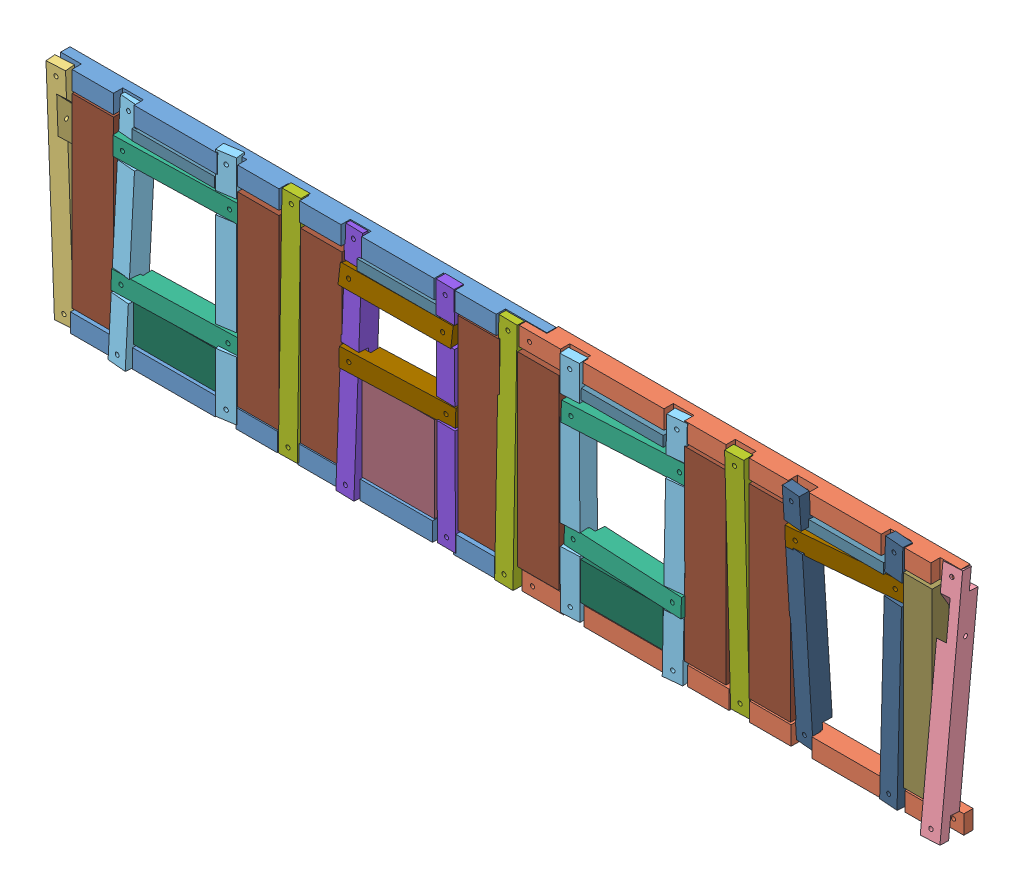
SolidWorks assembly habillage_ar.SLDASM, configuration Défaut (file format 3400). Lengths in mm.
Overall size (436.13 112.67 20.37).
39 component instances, 15 part files, 0 mates.
Components (placement in the parent):
- Base_D-AR-1: Base_D-AR.SLDPRT [Défaut] at (-112.7861 63.9546 0) size (235 9 9)
- Base_D-AR-2: Base_D-AR.SLDPRT [Défaut] at (-112.054 165.8116 0) size (235 9 9)
- Base_G-AR-1: Base_G-AR.SLDPRT [Défaut] at (112.7973 165.5355 -1.2408) size (209 9 9)
- Base_G-AR-2: Base_G-AR.SLDPRT [Défaut] at (114.0428 63.7916 -1.4349) size (209 9 9)
- montant_1-1: montant_1.SLDPRT [Default] at (-2.9572 132.1441 3.9027) x (-0.004401 0.999455 0.032729) z (-0.052403 0.032454 -0.998099) size (110 9 9)
- montant13-30-1: montant13-30.SLDPRT [Default] at (423.0728 131.2281 1.7351) x (0.000698 0.995067 -0.099202) z (-0.057602 -0.098997 -0.993419) size (110 9 9)
- montant_T3-1: montant_T3.SLDPRT [Default] at (-131.5515 107.1485 23.7671) x (0.016162 -0.999732 0.016584) z (-0.138703 -0.018667 -0.990158) size (110 9 9)
- montant_T3-2: montant_T3.SLDPRT [Default] at (-182.5214 107.7543 1.2074) x (-0.015948 -0.999145 0.038132) z (0.077862 -0.039262 -0.996191) size (110 9 9)
- montant_T3-3: montant_T3.SLDPRT [Default] at (33.4776 108.9259 15.0583) x (-0.012898 -0.9998 -0.015279) z (-0.059304 0.016018 -0.998111) size (110 9 9)
- montant_T3-4: montant_T3.SLDPRT [Default] at (84.6411 108.3026 20.8511) x (-0.011476 -0.9999 0.008311) z (-0.112134 -0.006972 -0.993669) size (110 9 9)
- traverse_T3-1: traverse_T3.SLDPRT [Défaut] at (-82.0217 101.9083 9.9749) x (0.999336 -0.008817 -0.035354) z (-0.035476 -0.014086 -0.999271) size (59 9 9)
- traverse_T3-2: traverse_T3.SLDPRT [Défaut] at (-81.2601 158.2739 10.1036) x (0.999367 -0.008338 -0.034588) z (-0.034419 0.019576 -0.999216) size (59 9 9)
- traverse_T3-3: traverse_T3.SLDPRT [Défaut] at (134.6624 102.7441 7.6629) x (0.999094 -0.009667 0.041454) z (0.041205 -0.024656 -0.998846) size (59 9 9)
- traverse_T3-4: traverse_T3.SLDPRT [Défaut] at (135.7736 155.9723 10.2375) x (0.998757 0.002751 -0.04977) z (-0.049575 -0.049026 -0.997566) size (59 9 9)
- montant-1: montant.SLDPRT [Default] at (-101.9884 107.8047 10.8283) x (0.000319 -0.999869 0.016167) z (-0.015513 -0.01617 -0.999749) size (110 9 9)
- montant_22-23-1: montant_22-23.SLDPRT [Default] at (-26.4133 106.9803 6.4657) x (0.007214 -0.999974 0.000745) z (0.024188 -0.00057 -0.999707) size (110 9 9)
- montant_22-23-2: montant_22-23.SLDPRT [Default] at (-73.1155 106.9217 6.1397) x (0.001018 -0.999208 0.039788) z (0.031865 -0.039735 -0.998702) size (110 9 9)
- traverse_T1-1: traverse_T1.SLDPRT [Défaut] at (244.6506 158.5372 11.1811) x (0.996925 0.009854 -0.077737) z (-0.077929 0.020816 -0.996742) size (54 9 9)
- traverse_T1-2: traverse_T1.SLDPRT [Défaut] at (28.2486 124.7282 10.1376) x (0.999015 -0.006579 -0.043893) z (-0.043953 -0.009279 -0.99899) size (54 9 9)
- traverse_T1-3: traverse_T1.SLDPRT [Défaut] at (27.2872 158.7279 8.637) x (0.999955 -0.002152 -0.00928) z (-0.00948 -0.128051 -0.991722) size (54 9 9)
- montant-2: montant.SLDPRT [Default] at (114.3488 107.7153 12.033) x (-0.001866 -0.999598 -0.02828) z (-0.032155 0.028325 -0.999081) size (110 9 9)
- montant-3: montant.SLDPRT [Default] at (2.5517 106.9516 7.2202) x (0.000682 -0.999815 0.019227) z (0.019177 -0.01921 -0.999632) size (110 9 9)
- montant_T1-1: montant_T1.SLDPRT [Default] at (188.847 109.0011 2.144) x (-0.012313 -0.999835 0.01333) z (0.066517 -0.014121 -0.997685) size (110 9 9)
- montant_T1-2: montant_T1.SLDPRT [Default] at (144.0019 108.5704 -0.7857) x (0.002177 -0.998164 -0.060535) z (0.085815 0.060499 -0.994473) size (110 9 9)
- AR_18-19-1: AR_18-19.SLDPRT [Défaut] at (-102.4719 74.3462 0.5) size (20 90 8)
- AR_29-30-2: AR_29-30.SLDPRT [Défaut] at (299.1927 74.6069 0.5) size (14 90 8)
- AR_18-19-2: AR_18-19.SLDPRT [Défaut] at (-22.5525 73.0855 0.5) size (20 90 8)
- AR_18-19-3: AR_18-19.SLDPRT [Défaut] at (7.8766 73.0855 0.5) size (20 90 8)
- AR_18-19-4: AR_18-19.SLDPRT [Défaut] at (83.9495 74.6069 0.5) size (20 90 8)
- AR_18-19-5: AR_18-19.SLDPRT [Défaut] at (112.8571 73.8462 0.5) size (20 90 8)
- AR_18-19-6: AR_18-19.SLDPRT [Défaut] at (193.4944 74.6069 0.5) size (20 90 8)
- AR_18-19-7: AR_18-19.SLDPRT [Défaut] at (224.6842 74.6069 0.5) size (20 90 8)
- AR_22-23b-1: AR_22-23b.SLDPRT [Défaut] at (37.6523 73.7529 0.5) size (35 41.5 8)
- AV_8-9h-1: AV_8-9h.SLDPRT [Défaut] at (35.1523 158.947 0.5) size (40 5 8)
- AV_8-9b-1: AV_8-9b.SLDPRT [Défaut] at (-72.8711 74.092 0.5) size (40 18 8)
- AV_8-9b-2: AV_8-9b.SLDPRT [Défaut] at (143.1757 74.092 0.5) size (40 18 8)
- AV_8-9h-2: AV_8-9h.SLDPRT [Défaut] at (-73.6319 158.947 0.5) size (40 5 8)
- AV_8-9h-3: AV_8-9h.SLDPRT [Défaut] at (249.6777 158.947 0.5) size (40 5 8)
- AV_8-9h-4: AV_8-9h.SLDPRT [Défaut] at (143.1757 158.947 0.5) size (40 5 8)
